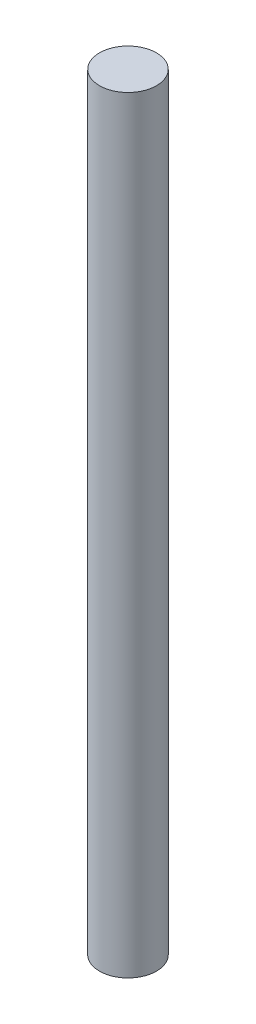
from build123d import *

# Parameters (mm, degrees)
SKETCH1_R           = 1.651
BOSS_EXTRUDE2_DEPTH = 44.45


with BuildPart() as part:
    # Sketch1 → Boss-Extrude2 (new body)
    with BuildSketch(Plane(origin=(0, 0, 0), x_dir=(1, 0, 0), z_dir=(0, 1, 0))):
        with Locations(Location((0, 0, 0), (0, 0, 270))):
            Circle(SKETCH1_R)
    extrude(amount=BOSS_EXTRUDE2_DEPTH)


solid = part.part
